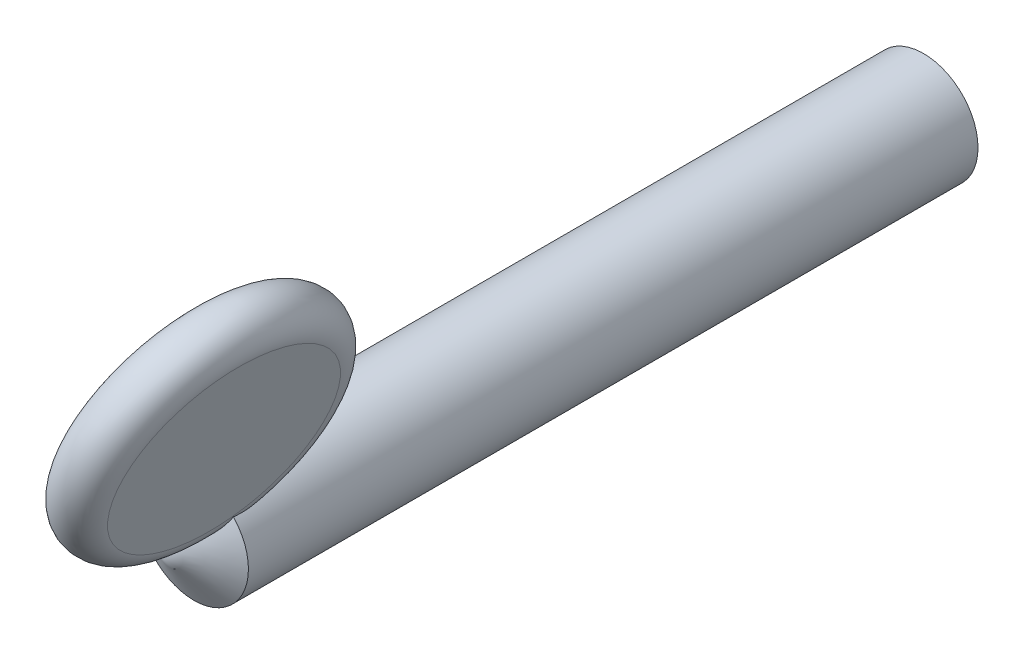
from build123d import *


with BuildPart() as part:
    # Sketch1 → Revolve1 (revolve)
    with BuildSketch(Plane(origin=(0, 0, 0), x_dir=(0, 0, -1), z_dir=(1, 0, 0)), mode=Mode.PRIVATE) as revolve1_sk:
        Polygon((0, 0), (-140, 0), (-133.99139381, 10), (0, 10), align=None)
    revolve(revolve1_sk.sketch.rotate(Axis((0, 0, 0), (0, 0, -1)), 270), axis=Axis((0, 0, 0), (0, 0, -1)))


with BuildPart() as body_2:
    # Sketch4 → Revolve2 (revolve)
    with BuildSketch(Plane(origin=(0, 3, 140), x_dir=(-0.9959957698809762, 0, -0.08940037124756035), z_dir=(0.08940037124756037, 0, -0.9959957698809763)), mode=Mode.PRIVATE) as revolve2_sk:
        with BuildLine():
            Line((-3.285954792, 24.294083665), (3.047378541, 6.380711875))
            ThreePointArc((3.047378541, 6.380711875), (0, 0), (-6.380711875, 3.047378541))
            Line((-6.380711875, 3.047378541), (-12.714045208, 20.960750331))
            Line((-12.714045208, 20.960750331), (-3.285954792, 24.294083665))
        make_face()
    revolve(revolve2_sk.sketch.rotate(Axis((3.272797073, 27.294083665, 140.293765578), (0.9390338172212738, -0.33333333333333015, 0.08428747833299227)), 358.286225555), axis=Axis((3.272797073, 27.294083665, 140.293765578), (0.9390338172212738, -0.33333333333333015, 0.08428747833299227)))


solid = Compound([part.part, body_2.part])
